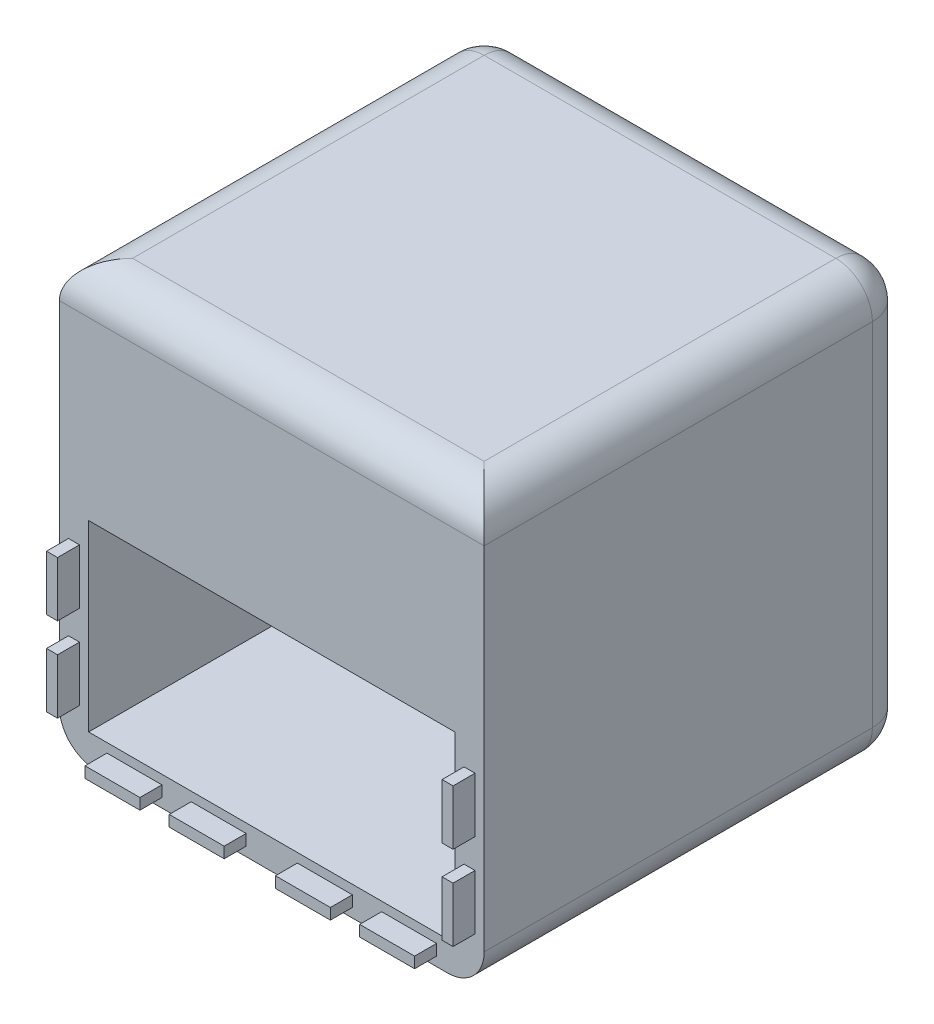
from build123d import *

# Parameters (mm, degrees)
CROQUIS1_W              = 116
CROQUIS1_H              = 116
SALIENTE_EXTRUIR1_DEPTH = 116
CROQUIS2_W              = 100
CROQUIS2_H              = 100
CORTAR_EXTRUIR1_DEPTH   = 108
CROQUIS3_W              = 100
CROQUIS3_H              = 100
SALIENTE_EXTRUIR2_DEPTH = 8
CROQUIS4_W              = 100
CROQUIS4_H              = 50
CORTAR_EXTRUIR2_DEPTH   = 8
CROQUIS5_W              = 3
CROQUIS5_H              = 15
CROQUIS5_W_2            = 15
CROQUIS5_H_2            = 3
SALIENTE_EXTRUIR3_DEPTH = 6
REDONDEO1_R             = 10


with BuildPart() as part:
    # Croquis1 → Saliente-Extruir1 (new body)
    with BuildSketch(Plane.XY):
        with Locations((58, 58)):
            Rectangle(CROQUIS1_W, CROQUIS1_H)
    extrude(amount=SALIENTE_EXTRUIR1_DEPTH)

    # Croquis2 → Cortar-Extruir1 (cut)
    with BuildSketch(Plane(origin=(0, 116, 0), x_dir=(1, 0, 0), z_dir=(0, 1, 0))):
        with Locations((58, -58)):
            Rectangle(CROQUIS2_W, CROQUIS2_H)
    extrude(amount=-CORTAR_EXTRUIR1_DEPTH, mode=Mode.SUBTRACT)

    # Croquis3 → Saliente-Extruir2 (add)
    with BuildSketch(Plane(origin=(0, 116, 0), x_dir=(1, 0, 0), z_dir=(0, 1, 0))):
        with Locations((58, -58)):
            Rectangle(CROQUIS3_W, CROQUIS3_H)
    extrude(amount=-SALIENTE_EXTRUIR2_DEPTH)

    # Croquis4 → Cortar-Extruir2 (cut)
    with BuildSketch(Plane.XY.offset(116)):
        with Locations((58, 33)):
            Rectangle(CROQUIS4_W, CROQUIS4_H)
    extrude(amount=-CORTAR_EXTRUIR2_DEPTH, mode=Mode.SUBTRACT)

    # Croquis5 → Saliente-Extruir3 (add)
    with BuildSketch(Plane.XY.offset(116)):
        with Locations((4, 20.5)):
            Rectangle(CROQUIS5_W, CROQUIS5_H)
        with Locations((4, 43.5)):
            Rectangle(CROQUIS5_W, CROQUIS5_H)
        with Locations((20.5, 4)):
            Rectangle(CROQUIS5_W_2, CROQUIS5_H_2)
        with Locations((43.5, 4)):
            Rectangle(CROQUIS5_W_2, CROQUIS5_H_2)
        with Locations((72.5, 4)):
            Rectangle(CROQUIS5_W_2, CROQUIS5_H_2)
        with Locations((95.5, 4)):
            Rectangle(CROQUIS5_W_2, CROQUIS5_H_2)
        with Locations((112, 20.5)):
            Rectangle(CROQUIS5_W, CROQUIS5_H)
        with Locations((112, 43.5)):
            Rectangle(CROQUIS5_W, CROQUIS5_H)
    extrude(amount=SALIENTE_EXTRUIR3_DEPTH)

    # Redondeo1
    redondeo1_edges = [part.edges().sort_by_distance(p)[0] for p in [
        (58, 116, 116),
        (58, 116, 0),
        (116, 58, 0),
        (58, 0, 0),
        (0, 58, 0),
        (0, 116, 58),
        (116, 116, 58),
        (116, 0, 58),
        (0, 0, 58),
    ]]
    fillet(redondeo1_edges, radius=REDONDEO1_R)


solid = part.part
